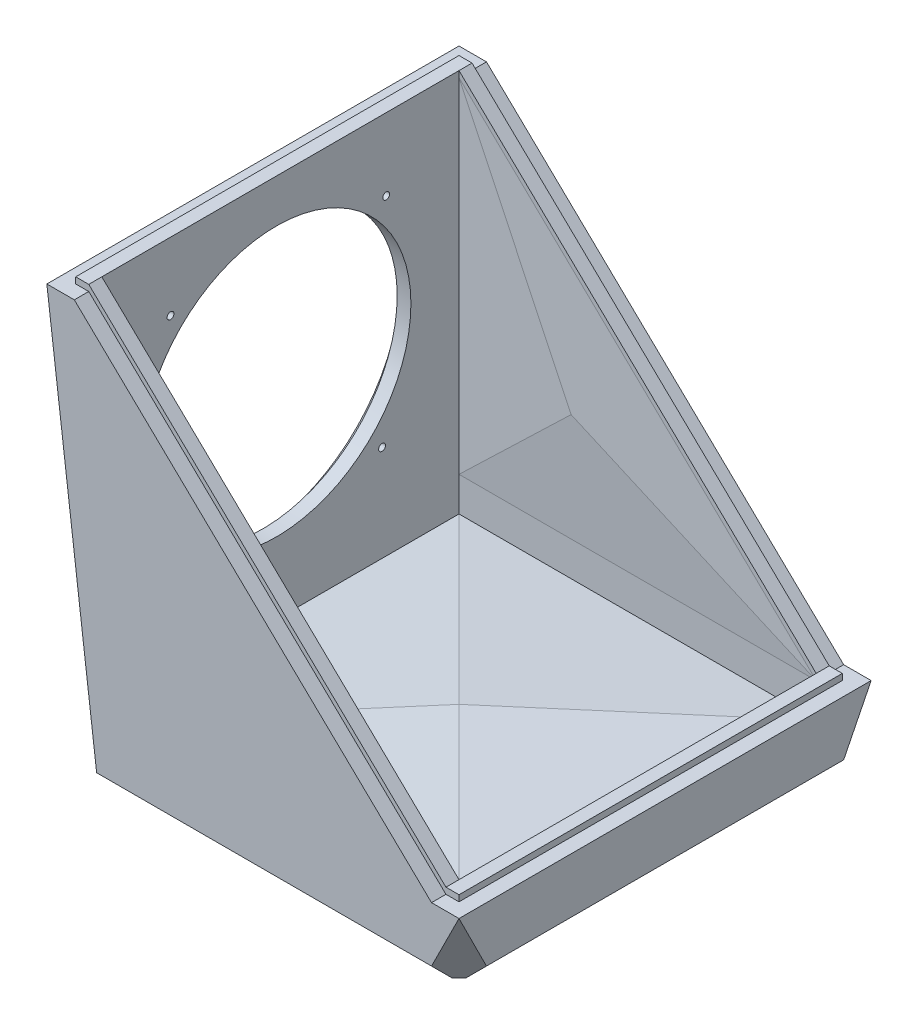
ISO-10303-21;
HEADER;
FILE_DESCRIPTION(('STEP AP214'),'2;1');
FILE_NAME('part.step','',(''),(''),'','','');
FILE_SCHEMA(('AUTOMOTIVE_DESIGN { 1 0 10303 214 1 1 1 1 }'));
ENDSEC;
DATA;
#1=APPLICATION_CONTEXT('core data for automotive mechanical design processes');
#2=APPLICATION_PROTOCOL_DEFINITION('international standard','automotive_design',2000,#1);
#3=PRODUCT_CONTEXT('',#1,'mechanical');
#4=PRODUCT('Part','Part','',(#3));
#5=PRODUCT_RELATED_PRODUCT_CATEGORY('part','',(#4));
#6=PRODUCT_DEFINITION_FORMATION('','',#4);
#7=PRODUCT_DEFINITION_CONTEXT('part definition',#1,'design');
#8=PRODUCT_DEFINITION('design','',#6,#7);
#9=PRODUCT_DEFINITION_SHAPE('','',#8);
#10=(LENGTH_UNIT() NAMED_UNIT(*) SI_UNIT(.MILLI.,.METRE.));
#11=(NAMED_UNIT(*) PLANE_ANGLE_UNIT() SI_UNIT($,.RADIAN.));
#12=(NAMED_UNIT(*) SI_UNIT($,.STERADIAN.) SOLID_ANGLE_UNIT());
#13=UNCERTAINTY_MEASURE_WITH_UNIT(LENGTH_MEASURE(1.E-05),#10,'distance_accuracy_value','');
#14=(GEOMETRIC_REPRESENTATION_CONTEXT(3) GLOBAL_UNCERTAINTY_ASSIGNED_CONTEXT((#13)) GLOBAL_UNIT_ASSIGNED_CONTEXT((#10,
#11,#12)) REPRESENTATION_CONTEXT('',''));
#15=CARTESIAN_POINT('',(0.,0.,0.));
#16=DIRECTION('',(0.,0.,1.));
#17=DIRECTION('',(1.,0.,0.));
#18=AXIS2_PLACEMENT_3D('',#15,#16,#17);
#19=CARTESIAN_POINT('',(-66.04,152.4,66.04));
#20=DIRECTION('',(0.693108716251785,0.720833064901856,0.));
#21=DIRECTION('',(-0.720833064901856,0.693108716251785,0.));
#22=AXIS2_PLACEMENT_3D('',#19,#20,#21);
#23=PLANE('',#22);
#24=DIRECTION('',(0.,0.,1.));
#25=VECTOR('',#24,1.);
#26=CARTESIAN_POINT('',(66.04,25.4,66.04));
#27=LINE('',#26,#25);
#28=CARTESIAN_POINT('',(66.04,25.4,70.866));
#29=VERTEX_POINT('',#28);
#30=CARTESIAN_POINT('',(66.0399999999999,25.4,76.2));
#31=VERTEX_POINT('',#30);
#32=EDGE_CURVE('E433',#29,#31,#27,.T.);
#33=ORIENTED_EDGE('',*,*,#32,.F.);
#34=DIRECTION('',(0.720833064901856,-0.693108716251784,0.));
#35=VECTOR('',#34,1.);
#36=CARTESIAN_POINT('',(66.04,25.4,70.866));
#37=LINE('',#36,#35);
#38=CARTESIAN_POINT('',(-66.04,152.4,70.866));
#39=VERTEX_POINT('',#38);
#40=EDGE_CURVE('E248',#39,#29,#37,.T.);
#41=ORIENTED_EDGE('',*,*,#40,.F.);
#42=DIRECTION('',(0.,0.,1.));
#43=VECTOR('',#42,1.);
#44=CARTESIAN_POINT('',(-66.04,152.4,66.04));
#45=LINE('',#44,#43);
#46=CARTESIAN_POINT('',(-66.04,152.4,76.2));
#47=VERTEX_POINT('',#46);
#48=EDGE_CURVE('E436',#39,#47,#45,.T.);
#49=ORIENTED_EDGE('',*,*,#48,.T.);
#50=DIRECTION('',(-0.720833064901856,0.693108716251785,0.));
#51=VECTOR('',#50,1.);
#52=CARTESIAN_POINT('',(-66.04,152.4,76.2));
#53=LINE('',#52,#51);
#54=EDGE_CURVE('E732',#31,#47,#53,.T.);
#55=ORIENTED_EDGE('',*,*,#54,.F.);
#56=EDGE_LOOP('',(#33,#41,#49,#55));
#57=FACE_BOUND('',#56,.T.);
#58=ADVANCED_FACE('F45',(#57),#23,.T.);
#59=CARTESIAN_POINT('',(-66.04,152.4,66.04));
#60=DIRECTION('',(-1.,0.,0.));
#61=DIRECTION('',(0.,0.,1.));
#62=AXIS2_PLACEMENT_3D('',#59,#60,#61);
#63=PLANE('',#62);
#64=CARTESIAN_POINT('',(-66.04,88.9,1.52276355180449));
#65=DIRECTION('',(1.,0.,0.));
#66=DIRECTION('',(0.,0.,-1.));
#67=AXIS2_PLACEMENT_3D('',#64,#65,#66);
#68=CIRCLE('',#67,49.784);
#69=CARTESIAN_POINT('',(-66.04,88.9,-48.2612364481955));
#70=VERTEX_POINT('',#69);
#71=EDGE_CURVE('E417',#70,#70,#68,.T.);
#72=ORIENTED_EDGE('',*,*,#71,.F.);
#73=EDGE_LOOP('',(#72));
#74=FACE_BOUND('',#73,.T.);
#75=CARTESIAN_POINT('',(-66.04,129.54,40.64));
#76=DIRECTION('',(1.,0.,0.));
#77=DIRECTION('',(0.,0.,-1.));
#78=AXIS2_PLACEMENT_3D('',#75,#76,#77);
#79=CIRCLE('',#78,1.27);
#80=CARTESIAN_POINT('',(-66.04,129.54,39.37));
#81=VERTEX_POINT('',#80);
#82=EDGE_CURVE('E411',#81,#81,#79,.T.);
#83=ORIENTED_EDGE('',*,*,#82,.F.);
#84=EDGE_LOOP('',(#83));
#85=FACE_BOUND('',#84,.T.);
#86=CARTESIAN_POINT('',(-66.04,49.7827635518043,42.1627635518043));
#87=DIRECTION('',(1.,0.,0.));
#88=DIRECTION('',(0.,1.,0.));
#89=AXIS2_PLACEMENT_3D('',#86,#87,#88);
#90=CIRCLE('',#89,1.27);
#91=CARTESIAN_POINT('',(-66.04,51.0527635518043,42.1627635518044));
#92=VERTEX_POINT('',#91);
#93=EDGE_CURVE('E405',#92,#92,#90,.T.);
#94=ORIENTED_EDGE('',*,*,#93,.F.);
#95=EDGE_LOOP('',(#94));
#96=FACE_BOUND('',#95,.T.);
#97=CARTESIAN_POINT('',(-66.04,48.26,-37.594472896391));
#98=DIRECTION('',(1.,0.,0.));
#99=DIRECTION('',(0.,0.,1.));
#100=AXIS2_PLACEMENT_3D('',#97,#98,#99);
#101=CIRCLE('',#100,1.27);
#102=CARTESIAN_POINT('',(-66.04,48.26,-36.324472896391));
#103=VERTEX_POINT('',#102);
#104=EDGE_CURVE('E399',#103,#103,#101,.T.);
#105=ORIENTED_EDGE('',*,*,#104,.F.);
#106=EDGE_LOOP('',(#105));
#107=FACE_BOUND('',#106,.T.);
#108=CARTESIAN_POINT('',(-66.04,128.017236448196,-39.1172364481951));
#109=DIRECTION('',(1.,0.,0.));
#110=DIRECTION('',(0.,-1.,0.));
#111=AXIS2_PLACEMENT_3D('',#108,#109,#110);
#112=CIRCLE('',#111,1.27);
#113=CARTESIAN_POINT('',(-66.04,126.747236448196,-39.1172364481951));
#114=VERTEX_POINT('',#113);
#115=EDGE_CURVE('E386',#114,#114,#112,.T.);
#116=ORIENTED_EDGE('',*,*,#115,.F.);
#117=EDGE_LOOP('',(#116));
#118=FACE_BOUND('',#117,.T.);
#119=DIRECTION('',(0.,-1.,0.));
#120=VECTOR('',#119,1.);
#121=CARTESIAN_POINT('',(-66.04,152.4,-66.04));
#122=LINE('',#121,#120);
#123=CARTESIAN_POINT('',(-66.04,152.4,-66.04));
#124=VERTEX_POINT('',#123);
#125=CARTESIAN_POINT('',(-66.0399999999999,25.4,-66.04));
#126=VERTEX_POINT('',#125);
#127=EDGE_CURVE('E422',#124,#126,#122,.T.);
#128=ORIENTED_EDGE('',*,*,#127,.F.);
#129=DIRECTION('',(0.,-1.,0.));
#130=VECTOR('',#129,1.);
#131=CARTESIAN_POINT('',(-66.04,154.686,-66.04));
#132=LINE('',#131,#130);
#133=CARTESIAN_POINT('',(-66.04,154.686,-66.04));
#134=VERTEX_POINT('',#133);
#135=EDGE_CURVE('E583',#134,#124,#132,.T.);
#136=ORIENTED_EDGE('',*,*,#135,.F.);
#137=DIRECTION('',(0.,0.,-1.));
#138=VECTOR('',#137,1.);
#139=CARTESIAN_POINT('',(-66.04,154.686,66.04));
#140=LINE('',#139,#138);
#141=CARTESIAN_POINT('',(-66.04,154.686,66.04));
#142=VERTEX_POINT('',#141);
#143=EDGE_CURVE('E543',#142,#134,#140,.T.);
#144=ORIENTED_EDGE('',*,*,#143,.F.);
#145=DIRECTION('',(0.,-1.,0.));
#146=VECTOR('',#145,1.);
#147=CARTESIAN_POINT('',(-66.04,154.686,66.04));
#148=LINE('',#147,#146);
#149=CARTESIAN_POINT('',(-66.04,152.4,66.04));
#150=VERTEX_POINT('',#149);
#151=EDGE_CURVE('E522',#142,#150,#148,.T.);
#152=ORIENTED_EDGE('',*,*,#151,.T.);
#153=DIRECTION('',(0.,-1.,0.));
#154=VECTOR('',#153,1.);
#155=CARTESIAN_POINT('',(-66.04,152.4,66.04));
#156=LINE('',#155,#154);
#157=CARTESIAN_POINT('',(-66.0399999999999,25.4,66.04));
#158=VERTEX_POINT('',#157);
#159=EDGE_CURVE('E772',#150,#158,#156,.T.);
#160=ORIENTED_EDGE('',*,*,#159,.T.);
#161=DIRECTION('',(0.,1.,0.));
#162=VECTOR('',#161,1.);
#163=CARTESIAN_POINT('',(-66.0399999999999,12.7,66.04));
#164=LINE('',#163,#162);
#165=CARTESIAN_POINT('',(-66.0400000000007,12.7,66.0399999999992));
#166=VERTEX_POINT('',#165);
#167=EDGE_CURVE('E456',#166,#158,#164,.T.);
#168=ORIENTED_EDGE('',*,*,#167,.F.);
#169=DIRECTION('',(0.,0.,1.));
#170=VECTOR('',#169,1.);
#171=CARTESIAN_POINT('',(-66.0399999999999,12.7,-66.04));
#172=LINE('',#171,#170);
#173=CARTESIAN_POINT('',(-66.0399999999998,12.7,-66.0400000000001));
#174=VERTEX_POINT('',#173);
#175=EDGE_CURVE('E315',#174,#166,#172,.T.);
#176=ORIENTED_EDGE('',*,*,#175,.F.);
#177=DIRECTION('',(0.,1.,0.));
#178=VECTOR('',#177,1.);
#179=CARTESIAN_POINT('',(-66.0399999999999,12.7,-66.04));
#180=LINE('',#179,#178);
#181=EDGE_CURVE('E322',#174,#126,#180,.T.);
#182=ORIENTED_EDGE('',*,*,#181,.T.);
#183=EDGE_LOOP('',(#128,#136,#144,#152,#160,#168,#176,#182));
#184=FACE_BOUND('',#183,.T.);
#185=ADVANCED_FACE('F606',(#74,#85,#96,#107,#118,#184),#63,.F.);
#186=CARTESIAN_POINT('',(66.04,12.7,-66.04));
#187=DIRECTION('',(1.,0.,0.));
#188=DIRECTION('',(0.,0.,-1.));
#189=AXIS2_PLACEMENT_3D('',#186,#187,#188);
#190=PLANE('',#189);
#191=DIRECTION('',(0.,0.,-1.));
#192=VECTOR('',#191,1.);
#193=CARTESIAN_POINT('',(66.04,27.686,-66.04));
#194=LINE('',#193,#192);
#195=CARTESIAN_POINT('',(66.04,27.686,66.04));
#196=VERTEX_POINT('',#195);
#197=CARTESIAN_POINT('',(66.04,27.686,-66.04));
#198=VERTEX_POINT('',#197);
#199=EDGE_CURVE('E264',#196,#198,#194,.T.);
#200=ORIENTED_EDGE('',*,*,#199,.T.);
#201=DIRECTION('',(0.,-1.,0.));
#202=VECTOR('',#201,1.);
#203=CARTESIAN_POINT('',(66.04,27.686,-66.04));
#204=LINE('',#203,#202);
#205=CARTESIAN_POINT('',(66.04,25.4,-66.04));
#206=VERTEX_POINT('',#205);
#207=EDGE_CURVE('E498',#198,#206,#204,.T.);
#208=ORIENTED_EDGE('',*,*,#207,.T.);
#209=DIRECTION('',(0.,1.,0.));
#210=VECTOR('',#209,1.);
#211=CARTESIAN_POINT('',(66.04,12.7,-66.04));
#212=LINE('',#211,#210);
#213=CARTESIAN_POINT('',(66.0400000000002,12.7,-66.0399999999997));
#214=VERTEX_POINT('',#213);
#215=EDGE_CURVE('E464',#214,#206,#212,.T.);
#216=ORIENTED_EDGE('',*,*,#215,.F.);
#217=DIRECTION('',(0.,0.,-1.));
#218=VECTOR('',#217,1.);
#219=CARTESIAN_POINT('',(66.04,12.7,-66.04));
#220=LINE('',#219,#218);
#221=CARTESIAN_POINT('',(66.0399999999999,12.7,66.04));
#222=VERTEX_POINT('',#221);
#223=EDGE_CURVE('E476',#222,#214,#220,.T.);
#224=ORIENTED_EDGE('',*,*,#223,.F.);
#225=DIRECTION('',(0.,1.,0.));
#226=VECTOR('',#225,1.);
#227=CARTESIAN_POINT('',(66.04,12.7,66.04));
#228=LINE('',#227,#226);
#229=CARTESIAN_POINT('',(66.04,25.4,66.04));
#230=VERTEX_POINT('',#229);
#231=EDGE_CURVE('E458',#222,#230,#228,.T.);
#232=ORIENTED_EDGE('',*,*,#231,.T.);
#233=DIRECTION('',(0.,-1.,0.));
#234=VECTOR('',#233,1.);
#235=CARTESIAN_POINT('',(66.04,27.686,66.04));
#236=LINE('',#235,#234);
#237=EDGE_CURVE('E520',#196,#230,#236,.T.);
#238=ORIENTED_EDGE('',*,*,#237,.F.);
#239=EDGE_LOOP('',(#200,#208,#216,#224,#232,#238));
#240=FACE_BOUND('',#239,.T.);
#241=ADVANCED_FACE('F497',(#240),#190,.F.);
#242=CARTESIAN_POINT('',(-76.2,25.4,-76.2));
#243=DIRECTION('',(0.,0.,1.));
#244=DIRECTION('',(1.,0.,0.));
#245=AXIS2_PLACEMENT_3D('',#242,#243,#244);
#246=PLANE('',#245);
#247=DIRECTION('',(-0.447213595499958,-0.894427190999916,0.));
#248=VECTOR('',#247,1.);
#249=CARTESIAN_POINT('',(76.2,25.4,-76.2));
#250=LINE('',#249,#248);
#251=CARTESIAN_POINT('',(76.2,25.4,-76.2));
#252=VERTEX_POINT('',#251);
#253=CARTESIAN_POINT('',(66.04,5.08000000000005,-76.2));
#254=VERTEX_POINT('',#253);
#255=EDGE_CURVE('E352',#252,#254,#250,.T.);
#256=ORIENTED_EDGE('',*,*,#255,.T.);
#257=DIRECTION('',(-1.,0.,0.));
#258=VECTOR('',#257,1.);
#259=CARTESIAN_POINT('',(-57.15,5.08000000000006,-76.2));
#260=LINE('',#259,#258);
#261=CARTESIAN_POINT('',(-57.785,5.08,-76.2));
#262=VERTEX_POINT('',#261);
#263=EDGE_CURVE('E687',#254,#262,#260,.T.);
#264=ORIENTED_EDGE('',*,*,#263,.T.);
#265=DIRECTION('',(0.124034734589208,-0.992277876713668,0.));
#266=VECTOR('',#265,1.);
#267=CARTESIAN_POINT('',(-76.2,152.4,-76.2));
#268=LINE('',#267,#266);
#269=CARTESIAN_POINT('',(-76.2,152.4,-76.2));
#270=VERTEX_POINT('',#269);
#271=EDGE_CURVE('E389',#270,#262,#268,.T.);
#272=ORIENTED_EDGE('',*,*,#271,.F.);
#273=DIRECTION('',(-1.,0.,0.));
#274=VECTOR('',#273,1.);
#275=CARTESIAN_POINT('',(-76.2,152.4,-76.2));
#276=LINE('',#275,#274);
#277=CARTESIAN_POINT('',(-66.04,152.4,-76.2));
#278=VERTEX_POINT('',#277);
#279=EDGE_CURVE('E427',#278,#270,#276,.T.);
#280=ORIENTED_EDGE('',*,*,#279,.F.);
#281=DIRECTION('',(-0.720833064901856,0.693108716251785,0.));
#282=VECTOR('',#281,1.);
#283=CARTESIAN_POINT('',(-66.04,152.4,-76.2));
#284=LINE('',#283,#282);
#285=CARTESIAN_POINT('',(66.04,25.4,-76.2));
#286=VERTEX_POINT('',#285);
#287=EDGE_CURVE('E423',#286,#278,#284,.T.);
#288=ORIENTED_EDGE('',*,*,#287,.F.);
#289=DIRECTION('',(-1.,0.,0.));
#290=VECTOR('',#289,1.);
#291=CARTESIAN_POINT('',(-76.2,25.4,-76.2));
#292=LINE('',#291,#290);
#293=EDGE_CURVE('E742',#252,#286,#292,.T.);
#294=ORIENTED_EDGE('',*,*,#293,.F.);
#295=EDGE_LOOP('',(#256,#264,#272,#280,#288,#294));
#296=FACE_BOUND('',#295,.T.);
#297=ADVANCED_FACE('F651',(#296),#246,.F.);
#298=CARTESIAN_POINT('',(-76.2,25.4,76.2));
#299=DIRECTION('',(1.,0.,0.));
#300=DIRECTION('',(0.,0.,-1.));
#301=AXIS2_PLACEMENT_3D('',#298,#299,#300);
#302=PLANE('',#301);
#303=CARTESIAN_POINT('',(-76.2,88.9,1.52276355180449));
#304=DIRECTION('',(1.,0.,0.));
#305=DIRECTION('',(0.,0.,-1.));
#306=AXIS2_PLACEMENT_3D('',#303,#304,#305);
#307=CIRCLE('',#306,56.2861034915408);
#308=CARTESIAN_POINT('',(-76.2,88.9,-54.7633399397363));
#309=VERTEX_POINT('',#308);
#310=EDGE_CURVE('E1257',#309,#309,#307,.T.);
#311=ORIENTED_EDGE('',*,*,#310,.T.);
#312=EDGE_LOOP('',(#311));
#313=FACE_BOUND('',#312,.T.);
#314=DIRECTION('',(0.,-0.992277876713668,0.124034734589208));
#315=VECTOR('',#314,1.);
#316=CARTESIAN_POINT('',(-76.2,152.4,-76.2));
#317=LINE('',#316,#315);
#318=CARTESIAN_POINT('',(-76.2,5.08000000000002,-57.785));
#319=VERTEX_POINT('',#318);
#320=EDGE_CURVE('E383',#270,#319,#317,.T.);
#321=ORIENTED_EDGE('',*,*,#320,.T.);
#322=DIRECTION('',(0.,0.,1.));
#323=VECTOR('',#322,1.);
#324=CARTESIAN_POINT('',(-76.2,5.08000000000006,57.15));
#325=LINE('',#324,#323);
#326=CARTESIAN_POINT('',(-76.1999999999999,5.07999999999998,57.785));
#327=VERTEX_POINT('',#326);
#328=EDGE_CURVE('E12',#319,#327,#325,.T.);
#329=ORIENTED_EDGE('',*,*,#328,.T.);
#330=DIRECTION('',(0.,-0.992277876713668,-0.124034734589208));
#331=VECTOR('',#330,1.);
#332=CARTESIAN_POINT('',(-76.2,152.4,76.2));
#333=LINE('',#332,#331);
#334=CARTESIAN_POINT('',(-76.2,152.4,76.2));
#335=VERTEX_POINT('',#334);
#336=EDGE_CURVE('E392',#335,#327,#333,.T.);
#337=ORIENTED_EDGE('',*,*,#336,.F.);
#338=DIRECTION('',(0.,0.,1.));
#339=VECTOR('',#338,1.);
#340=CARTESIAN_POINT('',(-76.2,152.4,66.04));
#341=LINE('',#340,#339);
#342=EDGE_CURVE('E443',#270,#335,#341,.T.);
#343=ORIENTED_EDGE('',*,*,#342,.F.);
#344=EDGE_LOOP('',(#321,#329,#337,#343));
#345=FACE_BOUND('',#344,.T.);
#346=ADVANCED_FACE('F644',(#313,#345),#302,.F.);
#347=CARTESIAN_POINT('',(0.,0.,0.));
#348=DIRECTION('',(0.,-1.,0.));
#349=DIRECTION('',(0.,0.,-1.));
#350=AXIS2_PLACEMENT_3D('',#347,#348,#349);
#351=PLANE('',#350);
#352=DIRECTION('',(0.707106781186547,0.,0.707106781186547));
#353=VECTOR('',#352,1.);
#354=CARTESIAN_POINT('',(63.5,0.,-76.2));
#355=LINE('',#354,#353);
#356=CARTESIAN_POINT('',(68.58,0.,-71.12));
#357=VERTEX_POINT('',#356);
#358=CARTESIAN_POINT('',(71.12,0.,-68.5800000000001));
#359=VERTEX_POINT('',#358);
#360=EDGE_CURVE('E697',#357,#359,#355,.T.);
#361=ORIENTED_EDGE('',*,*,#360,.T.);
#362=DIRECTION('',(0.,0.,1.));
#363=VECTOR('',#362,1.);
#364=CARTESIAN_POINT('',(71.12,0.,63.5));
#365=LINE('',#364,#363);
#366=CARTESIAN_POINT('',(71.12,0.,68.58));
#367=VERTEX_POINT('',#366);
#368=EDGE_CURVE('E793',#359,#367,#365,.T.);
#369=ORIENTED_EDGE('',*,*,#368,.T.);
#370=DIRECTION('',(0.707106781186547,0.,-0.707106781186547));
#371=VECTOR('',#370,1.);
#372=CARTESIAN_POINT('',(63.5,0.,76.2));
#373=LINE('',#372,#371);
#374=CARTESIAN_POINT('',(68.5800000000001,0.,71.1199999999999));
#375=VERTEX_POINT('',#374);
#376=EDGE_CURVE('E346',#375,#367,#373,.T.);
#377=ORIENTED_EDGE('',*,*,#376,.F.);
#378=DIRECTION('',(-1.,0.,0.));
#379=VECTOR('',#378,1.);
#380=CARTESIAN_POINT('',(-57.15,0.,71.1199999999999));
#381=LINE('',#380,#379);
#382=CARTESIAN_POINT('',(-62.23,0.,71.12));
#383=VERTEX_POINT('',#382);
#384=EDGE_CURVE('E795',#375,#383,#381,.T.);
#385=ORIENTED_EDGE('',*,*,#384,.T.);
#386=DIRECTION('',(0.707106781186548,0.,0.707106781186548));
#387=VECTOR('',#386,1.);
#388=CARTESIAN_POINT('',(-76.2,0.,57.15));
#389=LINE('',#388,#387);
#390=CARTESIAN_POINT('',(-71.1199999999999,0.,62.2300000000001));
#391=VERTEX_POINT('',#390);
#392=EDGE_CURVE('E370',#391,#383,#389,.T.);
#393=ORIENTED_EDGE('',*,*,#392,.F.);
#394=DIRECTION('',(0.,0.,-1.));
#395=VECTOR('',#394,1.);
#396=CARTESIAN_POINT('',(-71.1199999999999,0.,-57.1499999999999));
#397=LINE('',#396,#395);
#398=CARTESIAN_POINT('',(-71.12,0.,-62.23));
#399=VERTEX_POINT('',#398);
#400=EDGE_CURVE('E692',#391,#399,#397,.T.);
#401=ORIENTED_EDGE('',*,*,#400,.T.);
#402=DIRECTION('',(0.707106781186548,0.,-0.707106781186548));
#403=VECTOR('',#402,1.);
#404=CARTESIAN_POINT('',(-76.2,0.,-57.15));
#405=LINE('',#404,#403);
#406=CARTESIAN_POINT('',(-62.23,0.,-71.1199999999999));
#407=VERTEX_POINT('',#406);
#408=EDGE_CURVE('E375',#399,#407,#405,.T.);
#409=ORIENTED_EDGE('',*,*,#408,.T.);
#410=DIRECTION('',(1.,0.,0.));
#411=VECTOR('',#410,1.);
#412=CARTESIAN_POINT('',(63.4999999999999,0.,-71.1199999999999));
#413=LINE('',#412,#411);
#414=EDGE_CURVE('E685',#407,#357,#413,.T.);
#415=ORIENTED_EDGE('',*,*,#414,.T.);
#416=EDGE_LOOP('',(#361,#369,#377,#385,#393,#401,#409,#415));
#417=FACE_BOUND('',#416,.T.);
#418=ADVANCED_FACE('F641',(#417),#351,.T.);
#419=CARTESIAN_POINT('',(-76.2,25.4,76.2));
#420=DIRECTION('',(0.,0.,-1.));
#421=DIRECTION('',(-1.,0.,0.));
#422=AXIS2_PLACEMENT_3D('',#419,#420,#421);
#423=PLANE('',#422);
#424=DIRECTION('',(0.124034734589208,-0.992277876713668,0.));
#425=VECTOR('',#424,1.);
#426=CARTESIAN_POINT('',(-76.2,152.4,76.2));
#427=LINE('',#426,#425);
#428=CARTESIAN_POINT('',(-57.785,5.08000000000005,76.2));
#429=VERTEX_POINT('',#428);
#430=EDGE_CURVE('E374',#335,#429,#427,.T.);
#431=ORIENTED_EDGE('',*,*,#430,.T.);
#432=DIRECTION('',(1.,0.,0.));
#433=VECTOR('',#432,1.);
#434=CARTESIAN_POINT('',(63.4999999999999,5.08000000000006,76.2));
#435=LINE('',#434,#433);
#436=CARTESIAN_POINT('',(66.04,5.08000000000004,76.2));
#437=VERTEX_POINT('',#436);
#438=EDGE_CURVE('E787',#429,#437,#435,.T.);
#439=ORIENTED_EDGE('',*,*,#438,.T.);
#440=DIRECTION('',(-0.447213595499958,-0.894427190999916,0.));
#441=VECTOR('',#440,1.);
#442=CARTESIAN_POINT('',(76.2,25.4,76.2));
#443=LINE('',#442,#441);
#444=CARTESIAN_POINT('',(76.2,25.4,76.2));
#445=VERTEX_POINT('',#444);
#446=EDGE_CURVE('E353',#445,#437,#443,.T.);
#447=ORIENTED_EDGE('',*,*,#446,.F.);
#448=DIRECTION('',(1.,0.,0.));
#449=VECTOR('',#448,1.);
#450=CARTESIAN_POINT('',(-76.2,25.4,76.2));
#451=LINE('',#450,#449);
#452=EDGE_CURVE('E745',#31,#445,#451,.T.);
#453=ORIENTED_EDGE('',*,*,#452,.F.);
#454=ORIENTED_EDGE('',*,*,#54,.T.);
#455=DIRECTION('',(-1.,0.,0.));
#456=VECTOR('',#455,1.);
#457=CARTESIAN_POINT('',(-76.2,152.4,76.2));
#458=LINE('',#457,#456);
#459=EDGE_CURVE('E723',#47,#335,#458,.T.);
#460=ORIENTED_EDGE('',*,*,#459,.T.);
#461=EDGE_LOOP('',(#431,#439,#447,#453,#454,#460));
#462=FACE_BOUND('',#461,.T.);
#463=ADVANCED_FACE('F640',(#462),#423,.F.);
#464=CARTESIAN_POINT('',(0.,25.4,0.));
#465=DIRECTION('',(0.,-1.,0.));
#466=DIRECTION('',(0.,0.,-1.));
#467=AXIS2_PLACEMENT_3D('',#464,#465,#466);
#468=PLANE('',#467);
#469=DIRECTION('',(0.,0.,-1.));
#470=VECTOR('',#469,1.);
#471=CARTESIAN_POINT('',(66.04,25.4,-66.04));
#472=LINE('',#471,#470);
#473=CARTESIAN_POINT('',(66.04,25.4,-70.866));
#474=VERTEX_POINT('',#473);
#475=EDGE_CURVE('E438',#474,#286,#472,.T.);
#476=ORIENTED_EDGE('',*,*,#475,.F.);
#477=DIRECTION('',(1.,0.,0.));
#478=VECTOR('',#477,1.);
#479=CARTESIAN_POINT('',(66.04,25.4,-70.866));
#480=LINE('',#479,#478);
#481=CARTESIAN_POINT('',(70.866,25.4,-70.866));
#482=VERTEX_POINT('',#481);
#483=EDGE_CURVE('E275',#474,#482,#480,.T.);
#484=ORIENTED_EDGE('',*,*,#483,.T.);
#485=DIRECTION('',(0.,0.,-1.));
#486=VECTOR('',#485,1.);
#487=CARTESIAN_POINT('',(70.866,25.4,70.866));
#488=LINE('',#487,#486);
#489=CARTESIAN_POINT('',(70.866,25.4,70.866));
#490=VERTEX_POINT('',#489);
#491=EDGE_CURVE('E277',#490,#482,#488,.T.);
#492=ORIENTED_EDGE('',*,*,#491,.F.);
#493=DIRECTION('',(1.,0.,0.));
#494=VECTOR('',#493,1.);
#495=CARTESIAN_POINT('',(66.04,25.4,70.866));
#496=LINE('',#495,#494);
#497=EDGE_CURVE('E268',#29,#490,#496,.T.);
#498=ORIENTED_EDGE('',*,*,#497,.F.);
#499=ORIENTED_EDGE('',*,*,#32,.T.);
#500=ORIENTED_EDGE('',*,*,#452,.T.);
#501=DIRECTION('',(0.,0.,-1.));
#502=VECTOR('',#501,1.);
#503=CARTESIAN_POINT('',(76.2,25.4,76.2));
#504=LINE('',#503,#502);
#505=EDGE_CURVE('E726',#445,#252,#504,.T.);
#506=ORIENTED_EDGE('',*,*,#505,.T.);
#507=ORIENTED_EDGE('',*,*,#293,.T.);
#508=EDGE_LOOP('',(#476,#484,#492,#498,#499,#500,#506,#507));
#509=FACE_BOUND('',#508,.T.);
#510=ADVANCED_FACE('F636',(#509),#468,.F.);
#511=CARTESIAN_POINT('',(76.2,25.4,76.2));
#512=DIRECTION('',(-1.,0.,0.));
#513=DIRECTION('',(0.,0.,1.));
#514=AXIS2_PLACEMENT_3D('',#511,#512,#513);
#515=PLANE('',#514);
#516=DIRECTION('',(0.,-0.894427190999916,-0.447213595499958));
#517=VECTOR('',#516,1.);
#518=CARTESIAN_POINT('',(76.2,25.4,76.2));
#519=LINE('',#518,#517);
#520=CARTESIAN_POINT('',(76.2,5.08,66.04));
#521=VERTEX_POINT('',#520);
#522=EDGE_CURVE('E349',#445,#521,#519,.T.);
#523=ORIENTED_EDGE('',*,*,#522,.T.);
#524=DIRECTION('',(0.,0.,-1.));
#525=VECTOR('',#524,1.);
#526=CARTESIAN_POINT('',(76.2,5.08000000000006,-63.4999999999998));
#527=LINE('',#526,#525);
#528=CARTESIAN_POINT('',(76.2,5.08000000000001,-66.04));
#529=VERTEX_POINT('',#528);
#530=EDGE_CURVE('E691',#521,#529,#527,.T.);
#531=ORIENTED_EDGE('',*,*,#530,.T.);
#532=DIRECTION('',(0.,-0.894427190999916,0.447213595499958));
#533=VECTOR('',#532,1.);
#534=CARTESIAN_POINT('',(76.2,25.4,-76.2));
#535=LINE('',#534,#533);
#536=EDGE_CURVE('E362',#252,#529,#535,.T.);
#537=ORIENTED_EDGE('',*,*,#536,.F.);
#538=ORIENTED_EDGE('',*,*,#505,.F.);
#539=EDGE_LOOP('',(#523,#531,#537,#538));
#540=FACE_BOUND('',#539,.T.);
#541=ADVANCED_FACE('F639',(#540),#515,.F.);
#542=CARTESIAN_POINT('',(-76.2,152.4,66.04));
#543=DIRECTION('',(0.,1.,0.));
#544=DIRECTION('',(0.,0.,1.));
#545=AXIS2_PLACEMENT_3D('',#542,#543,#544);
#546=PLANE('',#545);
#547=DIRECTION('',(-1.,0.,0.));
#548=VECTOR('',#547,1.);
#549=CARTESIAN_POINT('',(-70.866,152.4,-70.866));
#550=LINE('',#549,#548);
#551=CARTESIAN_POINT('',(-66.04,152.4,-70.866));
#552=VERTEX_POINT('',#551);
#553=CARTESIAN_POINT('',(-70.866,152.4,-70.866));
#554=VERTEX_POINT('',#553);
#555=EDGE_CURVE('E558',#552,#554,#550,.T.);
#556=ORIENTED_EDGE('',*,*,#555,.F.);
#557=DIRECTION('',(0.,0.,-1.));
#558=VECTOR('',#557,1.);
#559=CARTESIAN_POINT('',(-66.04,152.4,-66.04));
#560=LINE('',#559,#558);
#561=EDGE_CURVE('E444',#552,#278,#560,.T.);
#562=ORIENTED_EDGE('',*,*,#561,.T.);
#563=ORIENTED_EDGE('',*,*,#279,.T.);
#564=ORIENTED_EDGE('',*,*,#342,.T.);
#565=ORIENTED_EDGE('',*,*,#459,.F.);
#566=ORIENTED_EDGE('',*,*,#48,.F.);
#567=DIRECTION('',(1.,0.,0.));
#568=VECTOR('',#567,1.);
#569=CARTESIAN_POINT('',(-66.04,152.4,70.866));
#570=LINE('',#569,#568);
#571=CARTESIAN_POINT('',(-70.866,152.4,70.866));
#572=VERTEX_POINT('',#571);
#573=EDGE_CURVE('E547',#572,#39,#570,.T.);
#574=ORIENTED_EDGE('',*,*,#573,.F.);
#575=DIRECTION('',(0.,0.,1.));
#576=VECTOR('',#575,1.);
#577=CARTESIAN_POINT('',(-70.866,152.4,70.866));
#578=LINE('',#577,#576);
#579=EDGE_CURVE('E70',#554,#572,#578,.T.);
#580=ORIENTED_EDGE('',*,*,#579,.F.);
#581=EDGE_LOOP('',(#556,#562,#563,#564,#565,#566,#574,#580));
#582=FACE_BOUND('',#581,.T.);
#583=ADVANCED_FACE('F634',(#582),#546,.T.);
#584=CARTESIAN_POINT('',(-66.04,152.4,-66.04));
#585=DIRECTION('',(-0.693108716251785,-0.720833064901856,0.));
#586=DIRECTION('',(0.720833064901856,-0.693108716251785,0.));
#587=AXIS2_PLACEMENT_3D('',#584,#585,#586);
#588=PLANE('',#587);
#589=ORIENTED_EDGE('',*,*,#561,.F.);
#590=DIRECTION('',(0.720833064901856,-0.693108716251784,0.));
#591=VECTOR('',#590,1.);
#592=CARTESIAN_POINT('',(66.04,25.4,-70.866));
#593=LINE('',#592,#591);
#594=EDGE_CURVE('E258',#552,#474,#593,.T.);
#595=ORIENTED_EDGE('',*,*,#594,.T.);
#596=ORIENTED_EDGE('',*,*,#475,.T.);
#597=ORIENTED_EDGE('',*,*,#287,.T.);
#598=EDGE_LOOP('',(#589,#595,#596,#597));
#599=FACE_BOUND('',#598,.T.);
#600=ADVANCED_FACE('F760',(#599),#588,.F.);
#601=CARTESIAN_POINT('',(-193.04,88.9,1.52276355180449));
#602=DIRECTION('',(1.,0.,0.));
#603=DIRECTION('',(0.,0.,-1.));
#604=AXIS2_PLACEMENT_3D('',#601,#602,#603);
#605=CYLINDRICAL_SURFACE('',#604,49.784);
#606=CARTESIAN_POINT('',(-71.12,88.9,1.52276355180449));
#607=DIRECTION('',(1.,0.,0.));
#608=DIRECTION('',(0.,0.,-1.));
#609=AXIS2_PLACEMENT_3D('',#606,#607,#608);
#610=CIRCLE('',#609,49.784);
#611=CARTESIAN_POINT('',(-71.12,88.9,-48.2612364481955));
#612=VERTEX_POINT('',#611);
#613=EDGE_CURVE('E694',#612,#612,#610,.F.);
#614=ORIENTED_EDGE('',*,*,#613,.T.);
#615=EDGE_LOOP('',(#614));
#616=FACE_BOUND('',#615,.T.);
#617=ORIENTED_EDGE('',*,*,#71,.T.);
#618=EDGE_LOOP('',(#617));
#619=FACE_BOUND('',#618,.T.);
#620=ADVANCED_FACE('F663',(#616,#619),#605,.F.);
#621=CARTESIAN_POINT('',(-76.2,88.9,1.52276355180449));
#622=DIRECTION('',(-1.,0.,0.));
#623=DIRECTION('',(0.,0.,1.));
#624=AXIS2_PLACEMENT_3D('',#621,#622,#623);
#625=CONICAL_SURFACE('',#624,56.2861034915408,0.90757121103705);
#626=ORIENTED_EDGE('',*,*,#613,.F.);
#627=EDGE_LOOP('',(#626));
#628=FACE_BOUND('',#627,.T.);
#629=ORIENTED_EDGE('',*,*,#310,.F.);
#630=EDGE_LOOP('',(#629));
#631=FACE_BOUND('',#630,.T.);
#632=ADVANCED_FACE('F659',(#628,#631),#625,.F.);
#633=CARTESIAN_POINT('',(-71.12,129.54,40.64));
#634=DIRECTION('',(1.,0.,0.));
#635=DIRECTION('',(0.,0.,-1.));
#636=AXIS2_PLACEMENT_3D('',#633,#634,#635);
#637=CYLINDRICAL_SURFACE('',#636,1.27);
#638=CARTESIAN_POINT('',(-71.12,129.54,40.64));
#639=DIRECTION('',(1.,0.,0.));
#640=DIRECTION('',(0.,0.,-1.));
#641=AXIS2_PLACEMENT_3D('',#638,#639,#640);
#642=CIRCLE('',#641,1.27);
#643=CARTESIAN_POINT('',(-71.12,129.54,39.37));
#644=VERTEX_POINT('',#643);
#645=EDGE_CURVE('E414',#644,#644,#642,.T.);
#646=ORIENTED_EDGE('',*,*,#645,.F.);
#647=EDGE_LOOP('',(#646));
#648=FACE_BOUND('',#647,.T.);
#649=ORIENTED_EDGE('',*,*,#82,.T.);
#650=EDGE_LOOP('',(#649));
#651=FACE_BOUND('',#650,.T.);
#652=ADVANCED_FACE('F662',(#648,#651),#637,.F.);
#653=CARTESIAN_POINT('',(-71.12,129.54,40.64));
#654=DIRECTION('',(1.,0.,0.));
#655=DIRECTION('',(0.,0.,-1.));
#656=AXIS2_PLACEMENT_3D('',#653,#654,#655);
#657=PLANE('',#656);
#658=ORIENTED_EDGE('',*,*,#645,.T.);
#659=EDGE_LOOP('',(#658));
#660=FACE_BOUND('',#659,.T.);
#661=ADVANCED_FACE('F835',(#660),#657,.T.);
#662=CARTESIAN_POINT('',(-71.12,49.7827635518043,42.1627635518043));
#663=DIRECTION('',(1.,0.,0.));
#664=DIRECTION('',(0.,0.,-1.));
#665=AXIS2_PLACEMENT_3D('',#662,#663,#664);
#666=CYLINDRICAL_SURFACE('',#665,1.27);
#667=CARTESIAN_POINT('',(-71.12,49.7827635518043,42.1627635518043));
#668=DIRECTION('',(1.,0.,0.));
#669=DIRECTION('',(0.,1.,0.));
#670=AXIS2_PLACEMENT_3D('',#667,#668,#669);
#671=CIRCLE('',#670,1.27);
#672=CARTESIAN_POINT('',(-71.12,51.0527635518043,42.1627635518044));
#673=VERTEX_POINT('',#672);
#674=EDGE_CURVE('E408',#673,#673,#671,.T.);
#675=ORIENTED_EDGE('',*,*,#674,.F.);
#676=EDGE_LOOP('',(#675));
#677=FACE_BOUND('',#676,.T.);
#678=ORIENTED_EDGE('',*,*,#93,.T.);
#679=EDGE_LOOP('',(#678));
#680=FACE_BOUND('',#679,.T.);
#681=ADVANCED_FACE('F831',(#677,#680),#666,.F.);
#682=CARTESIAN_POINT('',(-71.12,49.7827635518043,42.1627635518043));
#683=DIRECTION('',(1.,0.,0.));
#684=DIRECTION('',(0.,1.,0.));
#685=AXIS2_PLACEMENT_3D('',#682,#683,#684);
#686=PLANE('',#685);
#687=ORIENTED_EDGE('',*,*,#674,.T.);
#688=EDGE_LOOP('',(#687));
#689=FACE_BOUND('',#688,.T.);
#690=ADVANCED_FACE('F827',(#689),#686,.T.);
#691=CARTESIAN_POINT('',(-71.12,48.26,-37.594472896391));
#692=DIRECTION('',(1.,0.,0.));
#693=DIRECTION('',(0.,0.,-1.));
#694=AXIS2_PLACEMENT_3D('',#691,#692,#693);
#695=CYLINDRICAL_SURFACE('',#694,1.27);
#696=CARTESIAN_POINT('',(-71.12,48.26,-37.594472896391));
#697=DIRECTION('',(1.,0.,0.));
#698=DIRECTION('',(0.,0.,1.));
#699=AXIS2_PLACEMENT_3D('',#696,#697,#698);
#700=CIRCLE('',#699,1.27);
#701=CARTESIAN_POINT('',(-71.12,48.26,-36.324472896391));
#702=VERTEX_POINT('',#701);
#703=EDGE_CURVE('E402',#702,#702,#700,.T.);
#704=ORIENTED_EDGE('',*,*,#703,.F.);
#705=EDGE_LOOP('',(#704));
#706=FACE_BOUND('',#705,.T.);
#707=ORIENTED_EDGE('',*,*,#104,.T.);
#708=EDGE_LOOP('',(#707));
#709=FACE_BOUND('',#708,.T.);
#710=ADVANCED_FACE('F823',(#706,#709),#695,.F.);
#711=CARTESIAN_POINT('',(-71.12,48.26,-37.594472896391));
#712=DIRECTION('',(1.,0.,0.));
#713=DIRECTION('',(0.,0.,1.));
#714=AXIS2_PLACEMENT_3D('',#711,#712,#713);
#715=PLANE('',#714);
#716=ORIENTED_EDGE('',*,*,#703,.T.);
#717=EDGE_LOOP('',(#716));
#718=FACE_BOUND('',#717,.T.);
#719=ADVANCED_FACE('F819',(#718),#715,.T.);
#720=CARTESIAN_POINT('',(-71.12,128.017236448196,-39.1172364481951));
#721=DIRECTION('',(1.,0.,0.));
#722=DIRECTION('',(0.,0.,-1.));
#723=AXIS2_PLACEMENT_3D('',#720,#721,#722);
#724=CYLINDRICAL_SURFACE('',#723,1.27);
#725=CARTESIAN_POINT('',(-71.12,128.017236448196,-39.1172364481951));
#726=DIRECTION('',(1.,0.,0.));
#727=DIRECTION('',(0.,-1.,0.));
#728=AXIS2_PLACEMENT_3D('',#725,#726,#727);
#729=CIRCLE('',#728,1.27);
#730=CARTESIAN_POINT('',(-71.12,126.747236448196,-39.1172364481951));
#731=VERTEX_POINT('',#730);
#732=EDGE_CURVE('E396',#731,#731,#729,.T.);
#733=ORIENTED_EDGE('',*,*,#732,.F.);
#734=EDGE_LOOP('',(#733));
#735=FACE_BOUND('',#734,.T.);
#736=ORIENTED_EDGE('',*,*,#115,.T.);
#737=EDGE_LOOP('',(#736));
#738=FACE_BOUND('',#737,.T.);
#739=ADVANCED_FACE('F812',(#735,#738),#724,.F.);
#740=CARTESIAN_POINT('',(-71.12,128.017236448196,-39.1172364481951));
#741=DIRECTION('',(1.,0.,0.));
#742=DIRECTION('',(0.,-1.,0.));
#743=AXIS2_PLACEMENT_3D('',#740,#741,#742);
#744=PLANE('',#743);
#745=ORIENTED_EDGE('',*,*,#732,.T.);
#746=EDGE_LOOP('',(#745));
#747=FACE_BOUND('',#746,.T.);
#748=ADVANCED_FACE('F804',(#747),#744,.T.);
#749=CARTESIAN_POINT('',(-66.1581395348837,-8.26976744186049,-66.1581395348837));
#750=DIRECTION('',(-0.704360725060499,-0.0880450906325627,-0.704360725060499));
#751=DIRECTION('',(-0.707106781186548,0.,0.707106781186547));
#752=AXIS2_PLACEMENT_3D('',#749,#750,#751);
#753=PLANE('',#752);
#754=ORIENTED_EDGE('',*,*,#271,.T.);
#755=DIRECTION('',(-0.52615221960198,-0.601316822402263,0.601316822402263));
#756=VECTOR('',#755,1.);
#757=CARTESIAN_POINT('',(-67.5037288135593,-6.0271186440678,-65.0928813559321));
#758=LINE('',#757,#756);
#759=EDGE_CURVE('E54',#262,#407,#758,.T.);
#760=ORIENTED_EDGE('',*,*,#759,.T.);
#761=ORIENTED_EDGE('',*,*,#408,.F.);
#762=DIRECTION('',(-0.601316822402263,0.601316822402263,0.52615221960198));
#763=VECTOR('',#762,1.);
#764=CARTESIAN_POINT('',(-65.0928813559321,-6.0271186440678,-67.5037288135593));
#765=LINE('',#764,#763);
#766=EDGE_CURVE('E781',#399,#319,#765,.T.);
#767=ORIENTED_EDGE('',*,*,#766,.T.);
#768=ORIENTED_EDGE('',*,*,#320,.F.);
#769=EDGE_LOOP('',(#754,#760,#761,#767,#768));
#770=FACE_BOUND('',#769,.T.);
#771=ADVANCED_FACE('F802',(#770),#753,.T.);
#772=CARTESIAN_POINT('',(-66.1581395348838,-8.26976744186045,66.1581395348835));
#773=DIRECTION('',(-0.704360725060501,-0.0880450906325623,0.704360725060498));
#774=DIRECTION('',(0.707106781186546,0.,0.707106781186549));
#775=AXIS2_PLACEMENT_3D('',#772,#773,#774);
#776=PLANE('',#775);
#777=ORIENTED_EDGE('',*,*,#392,.T.);
#778=DIRECTION('',(0.526152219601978,0.601316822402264,0.601316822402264));
#779=VECTOR('',#778,1.);
#780=CARTESIAN_POINT('',(-67.5037288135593,-6.0271186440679,65.0928813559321));
#781=LINE('',#780,#779);
#782=EDGE_CURVE('E784',#383,#429,#781,.T.);
#783=ORIENTED_EDGE('',*,*,#782,.T.);
#784=ORIENTED_EDGE('',*,*,#430,.F.);
#785=ORIENTED_EDGE('',*,*,#336,.T.);
#786=DIRECTION('',(0.601316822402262,-0.601316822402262,0.526152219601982));
#787=VECTOR('',#786,1.);
#788=CARTESIAN_POINT('',(-65.0928813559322,-6.02711864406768,67.5037288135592));
#789=LINE('',#788,#787);
#790=EDGE_CURVE('E713',#327,#391,#789,.T.);
#791=ORIENTED_EDGE('',*,*,#790,.T.);
#792=EDGE_LOOP('',(#777,#783,#784,#785,#791));
#793=FACE_BOUND('',#792,.T.);
#794=ADVANCED_FACE('F712',(#793),#776,.T.);
#795=CARTESIAN_POINT('',(62.0888888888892,-31.0444444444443,-62.0888888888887));
#796=DIRECTION('',(-0.66666666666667,0.333333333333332,0.666666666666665));
#797=DIRECTION('',(0.707106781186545,0.,0.70710678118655));
#798=AXIS2_PLACEMENT_3D('',#795,#796,#797);
#799=PLANE('',#798);
#800=ORIENTED_EDGE('',*,*,#536,.T.);
#801=DIRECTION('',(-0.666666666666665,-0.666666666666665,-0.333333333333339));
#802=VECTOR('',#801,1.);
#803=CARTESIAN_POINT('',(107.808888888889,36.6888888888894,-50.235555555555));
#804=LINE('',#803,#802);
#805=EDGE_CURVE('E368',#529,#359,#804,.T.);
#806=ORIENTED_EDGE('',*,*,#805,.T.);
#807=ORIENTED_EDGE('',*,*,#360,.F.);
#808=DIRECTION('',(-0.333333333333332,0.666666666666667,-0.666666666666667));
#809=VECTOR('',#808,1.);
#810=CARTESIAN_POINT('',(50.2355555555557,36.6888888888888,-107.808888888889));
#811=LINE('',#810,#809);
#812=EDGE_CURVE('E684',#357,#254,#811,.T.);
#813=ORIENTED_EDGE('',*,*,#812,.T.);
#814=ORIENTED_EDGE('',*,*,#255,.F.);
#815=EDGE_LOOP('',(#800,#806,#807,#813,#814));
#816=FACE_BOUND('',#815,.T.);
#817=ADVANCED_FACE('F810',(#816),#799,.F.);
#818=CARTESIAN_POINT('',(62.0888888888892,-31.0444444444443,62.0888888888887));
#819=DIRECTION('',(-0.66666666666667,0.333333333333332,-0.666666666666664));
#820=DIRECTION('',(-0.707106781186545,0.,0.70710678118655));
#821=AXIS2_PLACEMENT_3D('',#818,#819,#820);
#822=PLANE('',#821);
#823=ORIENTED_EDGE('',*,*,#376,.T.);
#824=DIRECTION('',(0.666666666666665,0.666666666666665,-0.333333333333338));
#825=VECTOR('',#824,1.);
#826=CARTESIAN_POINT('',(73.9422222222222,2.82222222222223,67.1688888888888));
#827=LINE('',#826,#825);
#828=EDGE_CURVE('E789',#367,#521,#827,.T.);
#829=ORIENTED_EDGE('',*,*,#828,.T.);
#830=ORIENTED_EDGE('',*,*,#522,.F.);
#831=ORIENTED_EDGE('',*,*,#446,.T.);
#832=DIRECTION('',(0.333333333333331,-0.666666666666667,-0.666666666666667));
#833=VECTOR('',#832,1.);
#834=CARTESIAN_POINT('',(50.2355555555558,36.6888888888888,107.808888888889));
#835=LINE('',#834,#833);
#836=EDGE_CURVE('E791',#437,#375,#835,.T.);
#837=ORIENTED_EDGE('',*,*,#836,.T.);
#838=EDGE_LOOP('',(#823,#829,#830,#831,#837));
#839=FACE_BOUND('',#838,.T.);
#840=ADVANCED_FACE('F669',(#839),#822,.F.);
#841=CARTESIAN_POINT('',(76.2,5.08000000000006,76.2));
#842=DIRECTION('',(0.707106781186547,-0.707106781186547,0.));
#843=DIRECTION('',(0.,0.,1.));
#844=AXIS2_PLACEMENT_3D('',#841,#842,#843);
#845=PLANE('',#844);
#846=ORIENTED_EDGE('',*,*,#828,.F.);
#847=ORIENTED_EDGE('',*,*,#368,.F.);
#848=ORIENTED_EDGE('',*,*,#805,.F.);
#849=ORIENTED_EDGE('',*,*,#530,.F.);
#850=EDGE_LOOP('',(#846,#847,#848,#849));
#851=FACE_BOUND('',#850,.T.);
#852=ADVANCED_FACE('F665',(#851),#845,.T.);
#853=CARTESIAN_POINT('',(-76.2,5.08000000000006,76.2));
#854=DIRECTION('',(0.,-0.707106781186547,0.707106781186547));
#855=DIRECTION('',(-1.,0.,0.));
#856=AXIS2_PLACEMENT_3D('',#853,#854,#855);
#857=PLANE('',#856);
#858=ORIENTED_EDGE('',*,*,#782,.F.);
#859=ORIENTED_EDGE('',*,*,#384,.F.);
#860=ORIENTED_EDGE('',*,*,#836,.F.);
#861=ORIENTED_EDGE('',*,*,#438,.F.);
#862=EDGE_LOOP('',(#858,#859,#860,#861));
#863=FACE_BOUND('',#862,.T.);
#864=ADVANCED_FACE('F668',(#863),#857,.T.);
#865=CARTESIAN_POINT('',(-76.2,5.08000000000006,-76.2));
#866=DIRECTION('',(0.,-0.707106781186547,-0.707106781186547));
#867=DIRECTION('',(1.,0.,0.));
#868=AXIS2_PLACEMENT_3D('',#865,#866,#867);
#869=PLANE('',#868);
#870=ORIENTED_EDGE('',*,*,#812,.F.);
#871=ORIENTED_EDGE('',*,*,#414,.F.);
#872=ORIENTED_EDGE('',*,*,#759,.F.);
#873=ORIENTED_EDGE('',*,*,#263,.F.);
#874=EDGE_LOOP('',(#870,#871,#872,#873));
#875=FACE_BOUND('',#874,.T.);
#876=ADVANCED_FACE('F672',(#875),#869,.T.);
#877=CARTESIAN_POINT('',(-76.2,5.08000000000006,76.2));
#878=DIRECTION('',(-0.707106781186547,-0.707106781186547,0.));
#879=DIRECTION('',(0.,0.,-1.));
#880=AXIS2_PLACEMENT_3D('',#877,#878,#879);
#881=PLANE('',#880);
#882=ORIENTED_EDGE('',*,*,#766,.F.);
#883=ORIENTED_EDGE('',*,*,#400,.F.);
#884=ORIENTED_EDGE('',*,*,#790,.F.);
#885=ORIENTED_EDGE('',*,*,#328,.F.);
#886=EDGE_LOOP('',(#882,#883,#884,#885));
#887=FACE_BOUND('',#886,.T.);
#888=ADVANCED_FACE('F47',(#887),#881,.T.);
#889=CARTESIAN_POINT('',(0.,4.03351742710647,-67.3201819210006));
#890=DIRECTION('',(0.,0.0598081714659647,-0.998209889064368));
#891=DIRECTION('',(0.,0.998209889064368,0.0598081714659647));
#892=AXIS2_PLACEMENT_3D('',#889,#890,#891);
#893=PLANE('',#892);
#894=DIRECTION('',(1.,0.,0.));
#895=VECTOR('',#894,1.);
#896=CARTESIAN_POINT('',(66.04,25.4,-66.04));
#897=LINE('',#896,#895);
#898=EDGE_CURVE('E426',#126,#206,#897,.T.);
#899=ORIENTED_EDGE('',*,*,#898,.T.);
#900=DIRECTION('',(-0.900769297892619,0.433520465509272,0.0259745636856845));
#901=VECTOR('',#900,1.);
#902=CARTESIAN_POINT('',(66.04,25.4,-66.04));
#903=LINE('',#902,#901);
#904=CARTESIAN_POINT('',(-22.0444061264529,67.7930887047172,-63.5));
#905=VERTEX_POINT('',#904);
#906=EDGE_CURVE('E341',#206,#905,#903,.T.);
#907=ORIENTED_EDGE('',*,*,#906,.T.);
#908=DIRECTION('',(-0.719478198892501,-0.693271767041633,-0.0415376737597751));
#909=VECTOR('',#908,1.);
#910=CARTESIAN_POINT('',(-22.0444061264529,67.7930887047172,-63.5));
#911=LINE('',#910,#909);
#912=EDGE_CURVE('E336',#905,#126,#911,.T.);
#913=ORIENTED_EDGE('',*,*,#912,.T.);
#914=EDGE_LOOP('',(#899,#907,#913));
#915=FACE_BOUND('',#914,.T.);
#916=ADVANCED_FACE('F679',(#915),#893,.F.);
#917=CARTESIAN_POINT('',(-3.48037775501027,-3.61959286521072,-60.2839709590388));
#918=DIRECTION('',(-0.0575338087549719,-0.0598351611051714,-0.99654885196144));
#919=DIRECTION('',(0.,0.998202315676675,-0.059934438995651));
#920=AXIS2_PLACEMENT_3D('',#917,#918,#919);
#921=PLANE('',#920);
#922=ORIENTED_EDGE('',*,*,#906,.F.);
#923=DIRECTION('',(-0.720833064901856,0.693108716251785,0.));
#924=VECTOR('',#923,1.);
#925=CARTESIAN_POINT('',(-66.04,152.4,-66.04));
#926=LINE('',#925,#924);
#927=EDGE_CURVE('E761',#206,#124,#926,.T.);
#928=ORIENTED_EDGE('',*,*,#927,.T.);
#929=DIRECTION('',(0.461189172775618,-0.886902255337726,0.0266258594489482));
#930=VECTOR('',#929,1.);
#931=CARTESIAN_POINT('',(-66.04,152.4,-66.04));
#932=LINE('',#931,#930);
#933=EDGE_CURVE('E331',#124,#905,#932,.T.);
#934=ORIENTED_EDGE('',*,*,#933,.T.);
#935=EDGE_LOOP('',(#922,#928,#934));
#936=FACE_BOUND('',#935,.T.);
#937=ADVANCED_FACE('F1148',(#936),#921,.F.);
#938=CARTESIAN_POINT('',(3.58063795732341,0.,-62.0205879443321));
#939=DIRECTION('',(-0.0576370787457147,0.,0.998337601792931));
#940=DIRECTION('',(0.998337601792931,0.,0.0576370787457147));
#941=AXIS2_PLACEMENT_3D('',#938,#939,#940);
#942=PLANE('',#941);
#943=ORIENTED_EDGE('',*,*,#933,.F.);
#944=ORIENTED_EDGE('',*,*,#127,.T.);
#945=ORIENTED_EDGE('',*,*,#912,.F.);
#946=EDGE_LOOP('',(#943,#944,#945));
#947=FACE_BOUND('',#946,.T.);
#948=ADVANCED_FACE('F954',(#947),#942,.T.);
#949=CARTESIAN_POINT('',(0.,4.03351742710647,67.3201819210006));
#950=DIRECTION('',(0.,0.0598081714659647,0.998209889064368));
#951=DIRECTION('',(0.,0.998209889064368,-0.0598081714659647));
#952=AXIS2_PLACEMENT_3D('',#949,#950,#951);
#953=PLANE('',#952);
#954=DIRECTION('',(1.,0.,0.));
#955=VECTOR('',#954,1.);
#956=CARTESIAN_POINT('',(66.04,25.4,66.04));
#957=LINE('',#956,#955);
#958=EDGE_CURVE('E453',#158,#230,#957,.T.);
#959=ORIENTED_EDGE('',*,*,#958,.F.);
#960=DIRECTION('',(-0.719478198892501,-0.693271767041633,0.0415376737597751));
#961=VECTOR('',#960,1.);
#962=CARTESIAN_POINT('',(-22.0444061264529,67.7930887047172,63.5));
#963=LINE('',#962,#961);
#964=CARTESIAN_POINT('',(-22.0444061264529,67.7930887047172,63.5));
#965=VERTEX_POINT('',#964);
#966=EDGE_CURVE('E326',#965,#158,#963,.T.);
#967=ORIENTED_EDGE('',*,*,#966,.F.);
#968=DIRECTION('',(-0.900769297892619,0.433520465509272,-0.0259745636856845));
#969=VECTOR('',#968,1.);
#970=CARTESIAN_POINT('',(66.04,25.4,66.04));
#971=LINE('',#970,#969);
#972=EDGE_CURVE('E318',#230,#965,#971,.T.);
#973=ORIENTED_EDGE('',*,*,#972,.F.);
#974=EDGE_LOOP('',(#959,#967,#973));
#975=FACE_BOUND('',#974,.T.);
#976=ADVANCED_FACE('F945',(#975),#953,.F.);
#977=CARTESIAN_POINT('',(3.58063795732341,0.,62.0205879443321));
#978=DIRECTION('',(-0.0576370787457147,0.,-0.998337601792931));
#979=DIRECTION('',(0.998337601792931,0.,-0.0576370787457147));
#980=AXIS2_PLACEMENT_3D('',#977,#978,#979);
#981=PLANE('',#980);
#982=DIRECTION('',(0.461189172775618,-0.886902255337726,-0.0266258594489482));
#983=VECTOR('',#982,1.);
#984=CARTESIAN_POINT('',(-66.04,152.4,66.04));
#985=LINE('',#984,#983);
#986=EDGE_CURVE('E321',#150,#965,#985,.T.);
#987=ORIENTED_EDGE('',*,*,#986,.T.);
#988=ORIENTED_EDGE('',*,*,#966,.T.);
#989=ORIENTED_EDGE('',*,*,#159,.F.);
#990=EDGE_LOOP('',(#987,#988,#989));
#991=FACE_BOUND('',#990,.T.);
#992=ADVANCED_FACE('F935',(#991),#981,.T.);
#993=CARTESIAN_POINT('',(-3.48037775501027,-3.61959286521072,60.2839709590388));
#994=DIRECTION('',(-0.0575338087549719,-0.0598351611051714,0.99654885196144));
#995=DIRECTION('',(0.,0.998202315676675,0.059934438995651));
#996=AXIS2_PLACEMENT_3D('',#993,#994,#995);
#997=PLANE('',#996);
#998=ORIENTED_EDGE('',*,*,#972,.T.);
#999=ORIENTED_EDGE('',*,*,#986,.F.);
#1000=DIRECTION('',(-0.720833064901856,0.693108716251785,0.));
#1001=VECTOR('',#1000,1.);
#1002=CARTESIAN_POINT('',(-66.04,152.4,66.04));
#1003=LINE('',#1002,#1001);
#1004=EDGE_CURVE('E437',#230,#150,#1003,.T.);
#1005=ORIENTED_EDGE('',*,*,#1004,.F.);
#1006=EDGE_LOOP('',(#998,#999,#1005));
#1007=FACE_BOUND('',#1006,.T.);
#1008=ADVANCED_FACE('F930',(#1007),#997,.F.);
#1009=CARTESIAN_POINT('',(-66.0399999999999,12.7,-66.04));
#1010=DIRECTION('',(0.,0.,-1.));
#1011=DIRECTION('',(-1.,0.,0.));
#1012=AXIS2_PLACEMENT_3D('',#1009,#1010,#1011);
#1013=PLANE('',#1012);
#1014=ORIENTED_EDGE('',*,*,#898,.F.);
#1015=ORIENTED_EDGE('',*,*,#181,.F.);
#1016=DIRECTION('',(-1.,0.,0.));
#1017=VECTOR('',#1016,1.);
#1018=CARTESIAN_POINT('',(-66.0399999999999,12.7,-66.04));
#1019=LINE('',#1018,#1017);
#1020=EDGE_CURVE('E459',#214,#174,#1019,.T.);
#1021=ORIENTED_EDGE('',*,*,#1020,.F.);
#1022=ORIENTED_EDGE('',*,*,#215,.T.);
#1023=EDGE_LOOP('',(#1014,#1015,#1021,#1022));
#1024=FACE_BOUND('',#1023,.T.);
#1025=ADVANCED_FACE('F503',(#1024),#1013,.F.);
#1026=CARTESIAN_POINT('',(-66.0399999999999,12.7,66.04));
#1027=DIRECTION('',(0.,0.,1.));
#1028=DIRECTION('',(1.,0.,0.));
#1029=AXIS2_PLACEMENT_3D('',#1026,#1027,#1028);
#1030=PLANE('',#1029);
#1031=ORIENTED_EDGE('',*,*,#958,.T.);
#1032=ORIENTED_EDGE('',*,*,#231,.F.);
#1033=DIRECTION('',(1.,0.,0.));
#1034=VECTOR('',#1033,1.);
#1035=CARTESIAN_POINT('',(-66.0399999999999,12.7,66.04));
#1036=LINE('',#1035,#1034);
#1037=EDGE_CURVE('E474',#166,#222,#1036,.T.);
#1038=ORIENTED_EDGE('',*,*,#1037,.F.);
#1039=ORIENTED_EDGE('',*,*,#167,.T.);
#1040=EDGE_LOOP('',(#1031,#1032,#1038,#1039));
#1041=FACE_BOUND('',#1040,.T.);
#1042=ADVANCED_FACE('F516',(#1041),#1030,.F.);
#1043=CARTESIAN_POINT('',(-1.35964705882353,17.6754117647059,0.));
#1044=DIRECTION('',(0.0766964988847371,-0.997054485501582,0.));
#1045=DIRECTION('',(0.997054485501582,0.0766964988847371,0.));
#1046=AXIS2_PLACEMENT_3D('',#1043,#1044,#1045);
#1047=PLANE('',#1046);
#1048=DIRECTION('',(-0.706063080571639,-0.0543125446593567,-0.706063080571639));
#1049=VECTOR('',#1048,1.);
#1050=CARTESIAN_POINT('',(0.,17.78,0.));
#1051=LINE('',#1050,#1049);
#1052=CARTESIAN_POINT('',(0.,17.78,0.));
#1053=VERTEX_POINT('',#1052);
#1054=EDGE_CURVE('E310',#1053,#174,#1051,.T.);
#1055=ORIENTED_EDGE('',*,*,#1054,.T.);
#1056=ORIENTED_EDGE('',*,*,#175,.T.);
#1057=DIRECTION('',(0.706063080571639,0.0543125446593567,-0.706063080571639));
#1058=VECTOR('',#1057,1.);
#1059=CARTESIAN_POINT('',(-66.0399999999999,12.7,66.04));
#1060=LINE('',#1059,#1058);
#1061=EDGE_CURVE('E305',#166,#1053,#1060,.T.);
#1062=ORIENTED_EDGE('',*,*,#1061,.T.);
#1063=EDGE_LOOP('',(#1055,#1056,#1062));
#1064=FACE_BOUND('',#1063,.T.);
#1065=ADVANCED_FACE('F509',(#1064),#1047,.F.);
#1066=CARTESIAN_POINT('',(0.,17.6754117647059,-1.35964705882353));
#1067=DIRECTION('',(0.,0.997054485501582,-0.0766964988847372));
#1068=DIRECTION('',(0.,0.0766964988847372,0.997054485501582));
#1069=AXIS2_PLACEMENT_3D('',#1066,#1067,#1068);
#1070=PLANE('',#1069);
#1071=ORIENTED_EDGE('',*,*,#1054,.F.);
#1072=DIRECTION('',(0.706063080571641,-0.0543125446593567,-0.706063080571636));
#1073=VECTOR('',#1072,1.);
#1074=CARTESIAN_POINT('',(0.,17.78,0.));
#1075=LINE('',#1074,#1073);
#1076=EDGE_CURVE('E301',#1053,#214,#1075,.T.);
#1077=ORIENTED_EDGE('',*,*,#1076,.T.);
#1078=ORIENTED_EDGE('',*,*,#1020,.T.);
#1079=EDGE_LOOP('',(#1071,#1077,#1078));
#1080=FACE_BOUND('',#1079,.T.);
#1081=ADVANCED_FACE('F507',(#1080),#1070,.T.);
#1082=CARTESIAN_POINT('',(1.35964705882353,17.6754117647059,0.));
#1083=DIRECTION('',(-0.0766964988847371,-0.997054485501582,0.));
#1084=DIRECTION('',(0.997054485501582,-0.0766964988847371,0.));
#1085=AXIS2_PLACEMENT_3D('',#1082,#1083,#1084);
#1086=PLANE('',#1085);
#1087=DIRECTION('',(0.706063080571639,-0.0543125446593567,0.706063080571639));
#1088=VECTOR('',#1087,1.);
#1089=CARTESIAN_POINT('',(0.,17.78,0.));
#1090=LINE('',#1089,#1088);
#1091=EDGE_CURVE('E298',#1053,#222,#1090,.T.);
#1092=ORIENTED_EDGE('',*,*,#1091,.T.);
#1093=ORIENTED_EDGE('',*,*,#223,.T.);
#1094=ORIENTED_EDGE('',*,*,#1076,.F.);
#1095=EDGE_LOOP('',(#1092,#1093,#1094));
#1096=FACE_BOUND('',#1095,.T.);
#1097=ADVANCED_FACE('F491',(#1096),#1086,.F.);
#1098=CARTESIAN_POINT('',(0.,17.6754117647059,1.35964705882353));
#1099=DIRECTION('',(0.,0.997054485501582,0.0766964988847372));
#1100=DIRECTION('',(0.,-0.0766964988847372,0.997054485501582));
#1101=AXIS2_PLACEMENT_3D('',#1098,#1099,#1100);
#1102=PLANE('',#1101);
#1103=ORIENTED_EDGE('',*,*,#1091,.F.);
#1104=ORIENTED_EDGE('',*,*,#1061,.F.);
#1105=ORIENTED_EDGE('',*,*,#1037,.T.);
#1106=EDGE_LOOP('',(#1103,#1104,#1105));
#1107=FACE_BOUND('',#1106,.T.);
#1108=ADVANCED_FACE('F512',(#1107),#1102,.T.);
#1109=CARTESIAN_POINT('',(70.866,27.686,70.866));
#1110=DIRECTION('',(-1.,0.,0.));
#1111=DIRECTION('',(0.,0.,1.));
#1112=AXIS2_PLACEMENT_3D('',#1109,#1110,#1111);
#1113=PLANE('',#1112);
#1114=ORIENTED_EDGE('',*,*,#491,.T.);
#1115=DIRECTION('',(0.,-1.,0.));
#1116=VECTOR('',#1115,1.);
#1117=CARTESIAN_POINT('',(70.866,27.686,-70.866));
#1118=LINE('',#1117,#1116);
#1119=CARTESIAN_POINT('',(70.866,27.686,-70.866));
#1120=VERTEX_POINT('',#1119);
#1121=EDGE_CURVE('E295',#1120,#482,#1118,.T.);
#1122=ORIENTED_EDGE('',*,*,#1121,.F.);
#1123=DIRECTION('',(0.,0.,-1.));
#1124=VECTOR('',#1123,1.);
#1125=CARTESIAN_POINT('',(70.866,27.686,70.866));
#1126=LINE('',#1125,#1124);
#1127=CARTESIAN_POINT('',(70.866,27.686,70.866));
#1128=VERTEX_POINT('',#1127);
#1129=EDGE_CURVE('E262',#1128,#1120,#1126,.T.);
#1130=ORIENTED_EDGE('',*,*,#1129,.F.);
#1131=DIRECTION('',(0.,-1.,0.));
#1132=VECTOR('',#1131,1.);
#1133=CARTESIAN_POINT('',(70.866,27.686,70.866));
#1134=LINE('',#1133,#1132);
#1135=EDGE_CURVE('E293',#1128,#490,#1134,.T.);
#1136=ORIENTED_EDGE('',*,*,#1135,.T.);
#1137=EDGE_LOOP('',(#1114,#1122,#1130,#1136));
#1138=FACE_BOUND('',#1137,.T.);
#1139=ADVANCED_FACE('F974',(#1138),#1113,.F.);
#1140=CARTESIAN_POINT('',(66.04,27.686,-70.866));
#1141=DIRECTION('',(0.,0.,-1.));
#1142=DIRECTION('',(-1.,0.,0.));
#1143=AXIS2_PLACEMENT_3D('',#1140,#1141,#1142);
#1144=PLANE('',#1143);
#1145=ORIENTED_EDGE('',*,*,#483,.F.);
#1146=ORIENTED_EDGE('',*,*,#594,.F.);
#1147=ORIENTED_EDGE('',*,*,#555,.T.);
#1148=DIRECTION('',(0.,-1.,0.));
#1149=VECTOR('',#1148,1.);
#1150=CARTESIAN_POINT('',(-70.866,154.686,-70.866));
#1151=LINE('',#1150,#1149);
#1152=CARTESIAN_POINT('',(-70.866,154.686,-70.866));
#1153=VERTEX_POINT('',#1152);
#1154=EDGE_CURVE('E283',#1153,#554,#1151,.T.);
#1155=ORIENTED_EDGE('',*,*,#1154,.F.);
#1156=DIRECTION('',(-1.,0.,0.));
#1157=VECTOR('',#1156,1.);
#1158=CARTESIAN_POINT('',(-70.866,154.686,-70.866));
#1159=LINE('',#1158,#1157);
#1160=CARTESIAN_POINT('',(-66.04,154.686,-70.866));
#1161=VERTEX_POINT('',#1160);
#1162=EDGE_CURVE('E257',#1161,#1153,#1159,.T.);
#1163=ORIENTED_EDGE('',*,*,#1162,.F.);
#1164=DIRECTION('',(0.720833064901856,-0.693108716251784,0.));
#1165=VECTOR('',#1164,1.);
#1166=CARTESIAN_POINT('',(66.04,27.686,-70.866));
#1167=LINE('',#1166,#1165);
#1168=CARTESIAN_POINT('',(66.04,27.686,-70.866));
#1169=VERTEX_POINT('',#1168);
#1170=EDGE_CURVE('E239',#1161,#1169,#1167,.T.);
#1171=ORIENTED_EDGE('',*,*,#1170,.T.);
#1172=DIRECTION('',(1.,0.,0.));
#1173=VECTOR('',#1172,1.);
#1174=CARTESIAN_POINT('',(66.04,27.686,-70.866));
#1175=LINE('',#1174,#1173);
#1176=EDGE_CURVE('E255',#1169,#1120,#1175,.T.);
#1177=ORIENTED_EDGE('',*,*,#1176,.T.);
#1178=ORIENTED_EDGE('',*,*,#1121,.T.);
#1179=EDGE_LOOP('',(#1145,#1146,#1147,#1155,#1163,#1171,#1177,#1178));
#1180=FACE_BOUND('',#1179,.T.);
#1181=ADVANCED_FACE('F254',(#1180),#1144,.T.);
#1182=CARTESIAN_POINT('',(66.04,27.686,70.866));
#1183=DIRECTION('',(0.,0.,-1.));
#1184=DIRECTION('',(-1.,0.,0.));
#1185=AXIS2_PLACEMENT_3D('',#1182,#1183,#1184);
#1186=PLANE('',#1185);
#1187=ORIENTED_EDGE('',*,*,#497,.T.);
#1188=ORIENTED_EDGE('',*,*,#1135,.F.);
#1189=DIRECTION('',(1.,0.,0.));
#1190=VECTOR('',#1189,1.);
#1191=CARTESIAN_POINT('',(66.04,27.686,70.866));
#1192=LINE('',#1191,#1190);
#1193=CARTESIAN_POINT('',(66.04,27.686,70.866));
#1194=VERTEX_POINT('',#1193);
#1195=EDGE_CURVE('E296',#1194,#1128,#1192,.T.);
#1196=ORIENTED_EDGE('',*,*,#1195,.F.);
#1197=DIRECTION('',(0.720833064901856,-0.693108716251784,0.));
#1198=VECTOR('',#1197,1.);
#1199=CARTESIAN_POINT('',(66.04,27.686,70.866));
#1200=LINE('',#1199,#1198);
#1201=CARTESIAN_POINT('',(-66.04,154.686,70.866));
#1202=VERTEX_POINT('',#1201);
#1203=EDGE_CURVE('E531',#1202,#1194,#1200,.T.);
#1204=ORIENTED_EDGE('',*,*,#1203,.F.);
#1205=DIRECTION('',(1.,0.,0.));
#1206=VECTOR('',#1205,1.);
#1207=CARTESIAN_POINT('',(-66.04,154.686,70.866));
#1208=LINE('',#1207,#1206);
#1209=CARTESIAN_POINT('',(-70.866,154.686,70.866));
#1210=VERTEX_POINT('',#1209);
#1211=EDGE_CURVE('E540',#1210,#1202,#1208,.T.);
#1212=ORIENTED_EDGE('',*,*,#1211,.F.);
#1213=DIRECTION('',(0.,-1.,0.));
#1214=VECTOR('',#1213,1.);
#1215=CARTESIAN_POINT('',(-70.866,154.686,70.866));
#1216=LINE('',#1215,#1214);
#1217=EDGE_CURVE('E288',#1210,#572,#1216,.T.);
#1218=ORIENTED_EDGE('',*,*,#1217,.T.);
#1219=ORIENTED_EDGE('',*,*,#573,.T.);
#1220=ORIENTED_EDGE('',*,*,#40,.T.);
#1221=EDGE_LOOP('',(#1187,#1188,#1196,#1204,#1212,#1218,#1219,#1220));
#1222=FACE_BOUND('',#1221,.T.);
#1223=ADVANCED_FACE('F529',(#1222),#1186,.F.);
#1224=CARTESIAN_POINT('',(0.,27.686,0.));
#1225=DIRECTION('',(0.,-1.,0.));
#1226=DIRECTION('',(0.,0.,-1.));
#1227=AXIS2_PLACEMENT_3D('',#1224,#1225,#1226);
#1228=PLANE('',#1227);
#1229=ORIENTED_EDGE('',*,*,#1129,.T.);
#1230=ORIENTED_EDGE('',*,*,#1176,.F.);
#1231=DIRECTION('',(0.,0.,1.));
#1232=VECTOR('',#1231,1.);
#1233=CARTESIAN_POINT('',(66.04,27.686,-70.866));
#1234=LINE('',#1233,#1232);
#1235=EDGE_CURVE('E236',#1169,#198,#1234,.T.);
#1236=ORIENTED_EDGE('',*,*,#1235,.T.);
#1237=ORIENTED_EDGE('',*,*,#199,.F.);
#1238=EDGE_CURVE('E266',#1194,#196,#194,.T.);
#1239=ORIENTED_EDGE('',*,*,#1238,.F.);
#1240=ORIENTED_EDGE('',*,*,#1195,.T.);
#1241=EDGE_LOOP('',(#1229,#1230,#1236,#1237,#1239,#1240));
#1242=FACE_BOUND('',#1241,.T.);
#1243=ADVANCED_FACE('F260',(#1242),#1228,.F.);
#1244=CARTESIAN_POINT('',(-70.866,154.686,70.866));
#1245=DIRECTION('',(1.,0.,0.));
#1246=DIRECTION('',(0.,0.,-1.));
#1247=AXIS2_PLACEMENT_3D('',#1244,#1245,#1246);
#1248=PLANE('',#1247);
#1249=ORIENTED_EDGE('',*,*,#579,.T.);
#1250=ORIENTED_EDGE('',*,*,#1217,.F.);
#1251=DIRECTION('',(0.,0.,1.));
#1252=VECTOR('',#1251,1.);
#1253=CARTESIAN_POINT('',(-70.866,154.686,70.866));
#1254=LINE('',#1253,#1252);
#1255=EDGE_CURVE('E537',#1153,#1210,#1254,.T.);
#1256=ORIENTED_EDGE('',*,*,#1255,.F.);
#1257=ORIENTED_EDGE('',*,*,#1154,.T.);
#1258=EDGE_LOOP('',(#1249,#1250,#1256,#1257));
#1259=FACE_BOUND('',#1258,.T.);
#1260=ADVANCED_FACE('F611',(#1259),#1248,.F.);
#1261=CARTESIAN_POINT('',(0.,154.686,0.));
#1262=DIRECTION('',(0.,-1.,0.));
#1263=DIRECTION('',(0.,0.,-1.));
#1264=AXIS2_PLACEMENT_3D('',#1261,#1262,#1263);
#1265=PLANE('',#1264);
#1266=EDGE_CURVE('E538',#1202,#142,#140,.T.);
#1267=ORIENTED_EDGE('',*,*,#1266,.T.);
#1268=ORIENTED_EDGE('',*,*,#143,.T.);
#1269=DIRECTION('',(0.,0.,-1.));
#1270=VECTOR('',#1269,1.);
#1271=CARTESIAN_POINT('',(-66.04,154.686,-70.866));
#1272=LINE('',#1271,#1270);
#1273=EDGE_CURVE('E585',#134,#1161,#1272,.T.);
#1274=ORIENTED_EDGE('',*,*,#1273,.T.);
#1275=ORIENTED_EDGE('',*,*,#1162,.T.);
#1276=ORIENTED_EDGE('',*,*,#1255,.T.);
#1277=ORIENTED_EDGE('',*,*,#1211,.T.);
#1278=EDGE_LOOP('',(#1267,#1268,#1274,#1275,#1276,#1277));
#1279=FACE_BOUND('',#1278,.T.);
#1280=ADVANCED_FACE('F608',(#1279),#1265,.F.);
#1281=CARTESIAN_POINT('',(45.5579554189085,47.380273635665,0.));
#1282=DIRECTION('',(0.693108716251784,0.720833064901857,0.));
#1283=DIRECTION('',(-0.720833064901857,0.693108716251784,0.));
#1284=AXIS2_PLACEMENT_3D('',#1281,#1282,#1283);
#1285=PLANE('',#1284);
#1286=ORIENTED_EDGE('',*,*,#1203,.T.);
#1287=ORIENTED_EDGE('',*,*,#1238,.T.);
#1288=DIRECTION('',(-0.720833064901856,0.693108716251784,0.));
#1289=VECTOR('',#1288,1.);
#1290=CARTESIAN_POINT('',(66.04,27.686,66.04));
#1291=LINE('',#1290,#1289);
#1292=EDGE_CURVE('E62',#196,#142,#1291,.T.);
#1293=ORIENTED_EDGE('',*,*,#1292,.T.);
#1294=ORIENTED_EDGE('',*,*,#1266,.F.);
#1295=EDGE_LOOP('',(#1286,#1287,#1293,#1294));
#1296=FACE_BOUND('',#1295,.T.);
#1297=ADVANCED_FACE('F610',(#1296),#1285,.T.);
#1298=CARTESIAN_POINT('',(66.04,27.686,66.04));
#1299=DIRECTION('',(0.,0.,1.));
#1300=DIRECTION('',(1.,0.,0.));
#1301=AXIS2_PLACEMENT_3D('',#1298,#1299,#1300);
#1302=PLANE('',#1301);
#1303=ORIENTED_EDGE('',*,*,#1004,.T.);
#1304=ORIENTED_EDGE('',*,*,#151,.F.);
#1305=ORIENTED_EDGE('',*,*,#1292,.F.);
#1306=ORIENTED_EDGE('',*,*,#237,.T.);
#1307=EDGE_LOOP('',(#1303,#1304,#1305,#1306));
#1308=FACE_BOUND('',#1307,.T.);
#1309=ADVANCED_FACE('F613',(#1308),#1302,.F.);
#1310=CARTESIAN_POINT('',(45.5579554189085,47.380273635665,0.));
#1311=DIRECTION('',(0.693108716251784,0.720833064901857,0.));
#1312=DIRECTION('',(-0.720833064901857,0.693108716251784,0.));
#1313=AXIS2_PLACEMENT_3D('',#1310,#1311,#1312);
#1314=PLANE('',#1313);
#1315=ORIENTED_EDGE('',*,*,#1235,.F.);
#1316=ORIENTED_EDGE('',*,*,#1170,.F.);
#1317=ORIENTED_EDGE('',*,*,#1273,.F.);
#1318=DIRECTION('',(-0.720833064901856,0.693108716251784,0.));
#1319=VECTOR('',#1318,1.);
#1320=CARTESIAN_POINT('',(66.04,27.686,-66.04));
#1321=LINE('',#1320,#1319);
#1322=EDGE_CURVE('E242',#198,#134,#1321,.T.);
#1323=ORIENTED_EDGE('',*,*,#1322,.F.);
#1324=EDGE_LOOP('',(#1315,#1316,#1317,#1323));
#1325=FACE_BOUND('',#1324,.T.);
#1326=ADVANCED_FACE('F238',(#1325),#1314,.T.);
#1327=CARTESIAN_POINT('',(66.04,27.686,-66.04));
#1328=DIRECTION('',(0.,0.,1.));
#1329=DIRECTION('',(1.,0.,0.));
#1330=AXIS2_PLACEMENT_3D('',#1327,#1328,#1329);
#1331=PLANE('',#1330);
#1332=ORIENTED_EDGE('',*,*,#927,.F.);
#1333=ORIENTED_EDGE('',*,*,#207,.F.);
#1334=ORIENTED_EDGE('',*,*,#1322,.T.);
#1335=ORIENTED_EDGE('',*,*,#135,.T.);
#1336=EDGE_LOOP('',(#1332,#1333,#1334,#1335));
#1337=FACE_BOUND('',#1336,.T.);
#1338=ADVANCED_FACE('F603',(#1337),#1331,.T.);
#1339=CLOSED_SHELL('',(#58,#185,#241,#297,#346,#418,#463,#510,#541,#583,#600,#620,#632,#652,
#661,#681,#690,#710,#719,#739,#748,#771,#794,#817,#840,#852,#864,#876,#888,#916,#937,#948,#976,
#992,#1008,#1025,#1042,#1065,#1081,#1097,#1108,#1139,#1181,#1223,#1243,#1260,#1280,#1297,#1309,
#1326,#1338));
#1340=MANIFOLD_SOLID_BREP('B2',#1339);
#1341=ADVANCED_BREP_SHAPE_REPRESENTATION('',(#18,#1340),#14);
#1342=SHAPE_DEFINITION_REPRESENTATION(#9,#1341);
ENDSEC;
END-ISO-10303-21;
